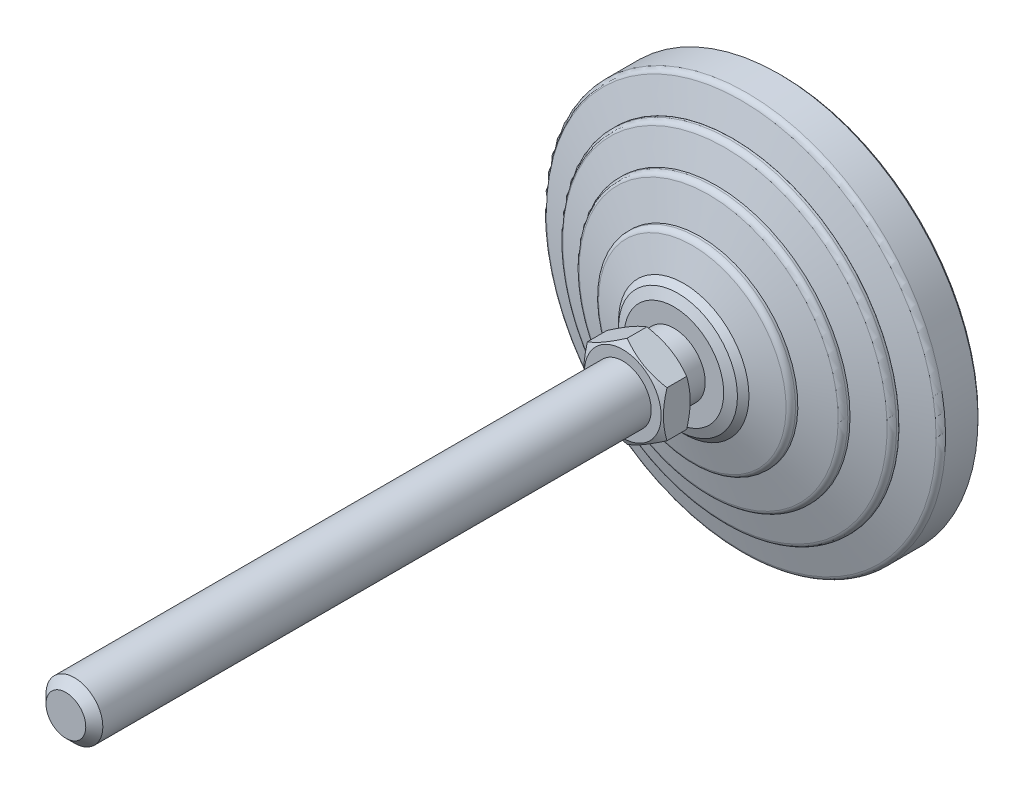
ISO-10303-21;
HEADER;
FILE_DESCRIPTION(('STEP AP214'),'2;1');
FILE_NAME('part.step','',(''),(''),'','','');
FILE_SCHEMA(('AUTOMOTIVE_DESIGN { 1 0 10303 214 1 1 1 1 }'));
ENDSEC;
DATA;
#1=APPLICATION_CONTEXT('core data for automotive mechanical design processes');
#2=APPLICATION_PROTOCOL_DEFINITION('international standard','automotive_design',2000,#1);
#3=PRODUCT_CONTEXT('',#1,'mechanical');
#4=PRODUCT('Part','Part','',(#3));
#5=PRODUCT_RELATED_PRODUCT_CATEGORY('part','',(#4));
#6=PRODUCT_DEFINITION_FORMATION('','',#4);
#7=PRODUCT_DEFINITION_CONTEXT('part definition',#1,'design');
#8=PRODUCT_DEFINITION('design','',#6,#7);
#9=PRODUCT_DEFINITION_SHAPE('','',#8);
#10=(LENGTH_UNIT() NAMED_UNIT(*) SI_UNIT(.MILLI.,.METRE.));
#11=(NAMED_UNIT(*) PLANE_ANGLE_UNIT() SI_UNIT($,.RADIAN.));
#12=(NAMED_UNIT(*) SI_UNIT($,.STERADIAN.) SOLID_ANGLE_UNIT());
#13=UNCERTAINTY_MEASURE_WITH_UNIT(LENGTH_MEASURE(1.E-05),#10,'distance_accuracy_value','');
#14=(GEOMETRIC_REPRESENTATION_CONTEXT(3) GLOBAL_UNCERTAINTY_ASSIGNED_CONTEXT((#13)) GLOBAL_UNIT_ASSIGNED_CONTEXT((#10,
#11,#12)) REPRESENTATION_CONTEXT('',''));
#15=CARTESIAN_POINT('',(0.,0.,0.));
#16=DIRECTION('',(0.,0.,1.));
#17=DIRECTION('',(1.,0.,0.));
#18=AXIS2_PLACEMENT_3D('',#15,#16,#17);
#19=CARTESIAN_POINT('',(-5.5,0.,23.));
#20=DIRECTION('',(0.,0.,1.));
#21=DIRECTION('',(0.,-1.,0.));
#22=AXIS2_PLACEMENT_3D('',#19,#20,#21);
#23=PLANE('',#22);
#24=CARTESIAN_POINT('',(0.,0.,22.9999999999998));
#25=DIRECTION('',(0.,0.,-1.));
#26=DIRECTION('',(-1.,0.,0.));
#27=AXIS2_PLACEMENT_3D('',#24,#25,#26);
#28=CIRCLE('',#27,6.75);
#29=CARTESIAN_POINT('',(-6.75,0.,22.9999999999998));
#30=VERTEX_POINT('',#29);
#31=EDGE_CURVE('E317',#30,#30,#28,.T.);
#32=ORIENTED_EDGE('',*,*,#31,.T.);
#33=EDGE_LOOP('',(#32));
#34=FACE_BOUND('',#33,.T.);
#35=CARTESIAN_POINT('',(0.,0.,23.));
#36=DIRECTION('',(0.,0.,-1.));
#37=DIRECTION('',(0.,1.,0.));
#38=AXIS2_PLACEMENT_3D('',#35,#36,#37);
#39=CIRCLE('',#38,5.5);
#40=CARTESIAN_POINT('',(0.,5.5,23.));
#41=VERTEX_POINT('',#40);
#42=EDGE_CURVE('E156',#41,#41,#39,.T.);
#43=ORIENTED_EDGE('',*,*,#42,.F.);
#44=EDGE_LOOP('',(#43));
#45=FACE_BOUND('',#44,.T.);
#46=ADVANCED_FACE('F14',(#34,#45),#23,.F.);
#47=CARTESIAN_POINT('',(0.,0.,0.));
#48=DIRECTION('',(0.,0.,-1.));
#49=DIRECTION('',(0.,1.,0.));
#50=AXIS2_PLACEMENT_3D('',#47,#48,#49);
#51=CYLINDRICAL_SURFACE('',#50,5.5);
#52=CARTESIAN_POINT('',(0.,0.,19.));
#53=DIRECTION('',(0.,0.,-1.));
#54=DIRECTION('',(0.,1.,0.));
#55=AXIS2_PLACEMENT_3D('',#52,#53,#54);
#56=CIRCLE('',#55,5.5);
#57=CARTESIAN_POINT('',(0.,5.5,19.));
#58=VERTEX_POINT('',#57);
#59=EDGE_CURVE('E153',#58,#58,#56,.T.);
#60=ORIENTED_EDGE('',*,*,#59,.F.);
#61=EDGE_LOOP('',(#60));
#62=FACE_BOUND('',#61,.T.);
#63=ORIENTED_EDGE('',*,*,#42,.T.);
#64=EDGE_LOOP('',(#63));
#65=FACE_BOUND('',#64,.T.);
#66=ADVANCED_FACE('F184',(#62,#65),#51,.T.);
#67=CARTESIAN_POINT('',(-8.75409836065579,0.,19.));
#68=DIRECTION('',(0.,0.,-1.));
#69=DIRECTION('',(0.,1.,0.));
#70=AXIS2_PLACEMENT_3D('',#67,#68,#69);
#71=PLANE('',#70);
#72=CARTESIAN_POINT('',(0.,0.,19.));
#73=DIRECTION('',(0.,0.,-1.));
#74=DIRECTION('',(0.,1.,0.));
#75=AXIS2_PLACEMENT_3D('',#72,#73,#74);
#76=CIRCLE('',#75,8.75409836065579);
#77=CARTESIAN_POINT('',(0.,8.75409836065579,19.));
#78=VERTEX_POINT('',#77);
#79=EDGE_CURVE('E150',#78,#78,#76,.T.);
#80=ORIENTED_EDGE('',*,*,#79,.F.);
#81=EDGE_LOOP('',(#80));
#82=FACE_BOUND('',#81,.T.);
#83=ORIENTED_EDGE('',*,*,#59,.T.);
#84=EDGE_LOOP('',(#83));
#85=FACE_BOUND('',#84,.T.);
#86=ADVANCED_FACE('F191',(#82,#85),#71,.F.);
#87=CARTESIAN_POINT('',(0.,0.,19.));
#88=DIRECTION('',(0.,0.,-1.));
#89=DIRECTION('',(0.,1.,0.));
#90=AXIS2_PLACEMENT_3D('',#87,#88,#89);
#91=CONICAL_SURFACE('',#90,8.75409836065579,1.17809724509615);
#92=CARTESIAN_POINT('',(0.,0.,18.2928932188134));
#93=DIRECTION('',(0.,0.,-1.));
#94=DIRECTION('',(0.,1.,0.));
#95=AXIS2_PLACEMENT_3D('',#92,#93,#94);
#96=CIRCLE('',#95,10.4612051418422);
#97=CARTESIAN_POINT('',(0.,10.4612051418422,18.2928932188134));
#98=VERTEX_POINT('',#97);
#99=EDGE_CURVE('E147',#98,#98,#96,.T.);
#100=ORIENTED_EDGE('',*,*,#99,.F.);
#101=EDGE_LOOP('',(#100));
#102=FACE_BOUND('',#101,.T.);
#103=ORIENTED_EDGE('',*,*,#79,.T.);
#104=EDGE_LOOP('',(#103));
#105=FACE_BOUND('',#104,.T.);
#106=ADVANCED_FACE('F548',(#102,#105),#91,.T.);
#107=CARTESIAN_POINT('',(0.,0.,18.2928932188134));
#108=DIRECTION('',(0.,0.,-1.));
#109=DIRECTION('',(0.,1.,0.));
#110=AXIS2_PLACEMENT_3D('',#107,#108,#109);
#111=CONICAL_SURFACE('',#110,10.4612051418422,0.785398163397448);
#112=CARTESIAN_POINT('',(0.,0.,17.2786885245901));
#113=DIRECTION('',(0.,0.,-1.));
#114=DIRECTION('',(0.,1.,0.));
#115=AXIS2_PLACEMENT_3D('',#112,#113,#114);
#116=CIRCLE('',#115,11.4754098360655);
#117=CARTESIAN_POINT('',(0.,11.4754098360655,17.2786885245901));
#118=VERTEX_POINT('',#117);
#119=EDGE_CURVE('E144',#118,#118,#116,.T.);
#120=ORIENTED_EDGE('',*,*,#119,.F.);
#121=EDGE_LOOP('',(#120));
#122=FACE_BOUND('',#121,.T.);
#123=ORIENTED_EDGE('',*,*,#99,.T.);
#124=EDGE_LOOP('',(#123));
#125=FACE_BOUND('',#124,.T.);
#126=ADVANCED_FACE('F539',(#122,#125),#111,.T.);
#127=CARTESIAN_POINT('',(0.,0.,17.2786885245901));
#128=DIRECTION('',(0.,0.,-1.));
#129=DIRECTION('',(0.,1.,0.));
#130=AXIS2_PLACEMENT_3D('',#127,#128,#129);
#131=CONICAL_SURFACE('',#130,11.4754098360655,1.27933953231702);
#132=CARTESIAN_POINT('',(0.,0.,15.7711726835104));
#133=DIRECTION('',(0.,0.,-1.));
#134=DIRECTION('',(0.,1.,0.));
#135=AXIS2_PLACEMENT_3D('',#132,#133,#134);
#136=CIRCLE('',#135,16.5004626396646);
#137=CARTESIAN_POINT('',(0.,16.5004626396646,15.7711726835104));
#138=VERTEX_POINT('',#137);
#139=EDGE_CURVE('E141',#138,#138,#136,.T.);
#140=ORIENTED_EDGE('',*,*,#139,.F.);
#141=EDGE_LOOP('',(#140));
#142=FACE_BOUND('',#141,.T.);
#143=ORIENTED_EDGE('',*,*,#119,.T.);
#144=EDGE_LOOP('',(#143));
#145=FACE_BOUND('',#144,.T.);
#146=ADVANCED_FACE('F530',(#142,#145),#131,.T.);
#147=CARTESIAN_POINT('',(0.,0.,14.8133463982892));
#148=DIRECTION('',(0.,0.,-1.));
#149=DIRECTION('',(0.,1.,0.));
#150=AXIS2_PLACEMENT_3D('',#147,#148,#149);
#151=TOROIDAL_SURFACE('',#150,16.2131147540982,1.);
#152=CARTESIAN_POINT('',(0.,0.,14.8133463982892));
#153=DIRECTION('',(0.,0.,-1.));
#154=DIRECTION('',(0.,1.,0.));
#155=AXIS2_PLACEMENT_3D('',#152,#153,#154);
#156=CIRCLE('',#155,17.2131147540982);
#157=CARTESIAN_POINT('',(0.,17.2131147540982,14.8133463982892));
#158=VERTEX_POINT('',#157);
#159=EDGE_CURVE('E138',#158,#158,#156,.T.);
#160=ORIENTED_EDGE('',*,*,#159,.F.);
#161=EDGE_LOOP('',(#160));
#162=FACE_BOUND('',#161,.T.);
#163=ORIENTED_EDGE('',*,*,#139,.T.);
#164=EDGE_LOOP('',(#163));
#165=FACE_BOUND('',#164,.T.);
#166=ADVANCED_FACE('F521',(#162,#165),#151,.T.);
#167=CARTESIAN_POINT('',(0.,0.,0.));
#168=DIRECTION('',(0.,0.,-1.));
#169=DIRECTION('',(0.,1.,0.));
#170=AXIS2_PLACEMENT_3D('',#167,#168,#169);
#171=CYLINDRICAL_SURFACE('',#170,17.2131147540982);
#172=CARTESIAN_POINT('',(0.,0.,14.4098360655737));
#173=DIRECTION('',(0.,0.,-1.));
#174=DIRECTION('',(0.,1.,0.));
#175=AXIS2_PLACEMENT_3D('',#172,#173,#174);
#176=CIRCLE('',#175,17.2131147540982);
#177=CARTESIAN_POINT('',(0.,17.2131147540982,14.4098360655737));
#178=VERTEX_POINT('',#177);
#179=EDGE_CURVE('E135',#178,#178,#176,.T.);
#180=ORIENTED_EDGE('',*,*,#179,.F.);
#181=EDGE_LOOP('',(#180));
#182=FACE_BOUND('',#181,.T.);
#183=ORIENTED_EDGE('',*,*,#159,.T.);
#184=EDGE_LOOP('',(#183));
#185=FACE_BOUND('',#184,.T.);
#186=ADVANCED_FACE('F512',(#182,#185),#171,.T.);
#187=CARTESIAN_POINT('',(0.,0.,14.4098360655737));
#188=DIRECTION('',(0.,0.,-1.));
#189=DIRECTION('',(0.,1.,0.));
#190=AXIS2_PLACEMENT_3D('',#187,#188,#189);
#191=CONICAL_SURFACE('',#190,17.2131147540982,1.30454427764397);
#192=CARTESIAN_POINT('',(0.,0.,12.8894925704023));
#193=DIRECTION('',(0.,0.,-1.));
#194=DIRECTION('',(0.,1.,0.));
#195=AXIS2_PLACEMENT_3D('',#192,#193,#194);
#196=CIRCLE('',#195,22.7877075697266);
#197=CARTESIAN_POINT('',(0.,22.7877075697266,12.8894925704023));
#198=VERTEX_POINT('',#197);
#199=EDGE_CURVE('E132',#198,#198,#196,.T.);
#200=ORIENTED_EDGE('',*,*,#199,.F.);
#201=EDGE_LOOP('',(#200));
#202=FACE_BOUND('',#201,.T.);
#203=ORIENTED_EDGE('',*,*,#179,.T.);
#204=EDGE_LOOP('',(#203));
#205=FACE_BOUND('',#204,.T.);
#206=ADVANCED_FACE('F503',(#202,#205),#191,.T.);
#207=CARTESIAN_POINT('',(0.,0.,11.9247287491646));
#208=DIRECTION('',(0.,0.,-1.));
#209=DIRECTION('',(0.,1.,0.));
#210=AXIS2_PLACEMENT_3D('',#207,#208,#209);
#211=TOROIDAL_SURFACE('',#210,22.5245901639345,1.);
#212=CARTESIAN_POINT('',(0.,0.,11.9247287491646));
#213=DIRECTION('',(0.,0.,-1.));
#214=DIRECTION('',(0.,1.,0.));
#215=AXIS2_PLACEMENT_3D('',#212,#213,#214);
#216=CIRCLE('',#215,23.5245901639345);
#217=CARTESIAN_POINT('',(0.,23.5245901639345,11.9247287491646));
#218=VERTEX_POINT('',#217);
#219=EDGE_CURVE('E129',#218,#218,#216,.T.);
#220=ORIENTED_EDGE('',*,*,#219,.F.);
#221=EDGE_LOOP('',(#220));
#222=FACE_BOUND('',#221,.T.);
#223=ORIENTED_EDGE('',*,*,#199,.T.);
#224=EDGE_LOOP('',(#223));
#225=FACE_BOUND('',#224,.T.);
#226=ADVANCED_FACE('F494',(#222,#225),#211,.T.);
#227=CARTESIAN_POINT('',(0.,0.,0.));
#228=DIRECTION('',(0.,0.,-1.));
#229=DIRECTION('',(0.,1.,0.));
#230=AXIS2_PLACEMENT_3D('',#227,#228,#229);
#231=CYLINDRICAL_SURFACE('',#230,23.5245901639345);
#232=CARTESIAN_POINT('',(0.,0.,11.5409836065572));
#233=DIRECTION('',(0.,0.,-1.));
#234=DIRECTION('',(0.,1.,0.));
#235=AXIS2_PLACEMENT_3D('',#232,#233,#234);
#236=CIRCLE('',#235,23.5245901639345);
#237=CARTESIAN_POINT('',(0.,23.5245901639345,11.5409836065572));
#238=VERTEX_POINT('',#237);
#239=EDGE_CURVE('E126',#238,#238,#236,.T.);
#240=ORIENTED_EDGE('',*,*,#239,.F.);
#241=EDGE_LOOP('',(#240));
#242=FACE_BOUND('',#241,.T.);
#243=ORIENTED_EDGE('',*,*,#219,.T.);
#244=EDGE_LOOP('',(#243));
#245=FACE_BOUND('',#244,.T.);
#246=ADVANCED_FACE('F485',(#242,#245),#231,.T.);
#247=CARTESIAN_POINT('',(0.,0.,11.5409836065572));
#248=DIRECTION('',(0.,0.,-1.));
#249=DIRECTION('',(0.,1.,0.));
#250=AXIS2_PLACEMENT_3D('',#247,#248,#249);
#251=CONICAL_SURFACE('',#250,23.5245901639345,1.2787125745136);
#252=CARTESIAN_POINT('',(0.,0.,10.0337743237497));
#253=DIRECTION('',(0.,0.,-1.));
#254=DIRECTION('',(0.,1.,0.));
#255=AXIS2_PLACEMENT_3D('',#252,#253,#254);
#256=CIRCLE('',#255,28.5372004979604);
#257=CARTESIAN_POINT('',(0.,28.5372004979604,10.0337743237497));
#258=VERTEX_POINT('',#257);
#259=EDGE_CURVE('E123',#258,#258,#256,.T.);
#260=ORIENTED_EDGE('',*,*,#259,.F.);
#261=EDGE_LOOP('',(#260));
#262=FACE_BOUND('',#261,.T.);
#263=ORIENTED_EDGE('',*,*,#239,.T.);
#264=EDGE_LOOP('',(#263));
#265=FACE_BOUND('',#264,.T.);
#266=ADVANCED_FACE('F476',(#262,#265),#251,.T.);
#267=CARTESIAN_POINT('',(0.,0.,9.07612838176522));
#268=DIRECTION('',(0.,0.,-1.));
#269=DIRECTION('',(0.,1.,0.));
#270=AXIS2_PLACEMENT_3D('',#267,#268,#269);
#271=TOROIDAL_SURFACE('',#270,28.2492521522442,1.);
#272=CARTESIAN_POINT('',(0.,0.,9.07612838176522));
#273=DIRECTION('',(0.,0.,-1.));
#274=DIRECTION('',(0.,1.,0.));
#275=AXIS2_PLACEMENT_3D('',#272,#273,#274);
#276=CIRCLE('',#275,29.2492521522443);
#277=CARTESIAN_POINT('',(0.,29.2492521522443,9.07612838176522));
#278=VERTEX_POINT('',#277);
#279=EDGE_CURVE('E120',#278,#278,#276,.T.);
#280=ORIENTED_EDGE('',*,*,#279,.F.);
#281=EDGE_LOOP('',(#280));
#282=FACE_BOUND('',#281,.T.);
#283=ORIENTED_EDGE('',*,*,#259,.T.);
#284=EDGE_LOOP('',(#283));
#285=FACE_BOUND('',#284,.T.);
#286=ADVANCED_FACE('F467',(#282,#285),#271,.T.);
#287=CARTESIAN_POINT('',(0.,0.,0.));
#288=DIRECTION('',(0.,0.,-1.));
#289=DIRECTION('',(0.,1.,0.));
#290=AXIS2_PLACEMENT_3D('',#287,#288,#289);
#291=CYLINDRICAL_SURFACE('',#290,29.2492521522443);
#292=CARTESIAN_POINT('',(0.,0.,8.67213114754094));
#293=DIRECTION('',(0.,0.,-1.));
#294=DIRECTION('',(0.,1.,0.));
#295=AXIS2_PLACEMENT_3D('',#292,#293,#294);
#296=CIRCLE('',#295,29.2492521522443);
#297=CARTESIAN_POINT('',(0.,29.2492521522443,8.67213114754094));
#298=VERTEX_POINT('',#297);
#299=EDGE_CURVE('E117',#298,#298,#296,.T.);
#300=ORIENTED_EDGE('',*,*,#299,.F.);
#301=EDGE_LOOP('',(#300));
#302=FACE_BOUND('',#301,.T.);
#303=ORIENTED_EDGE('',*,*,#279,.T.);
#304=EDGE_LOOP('',(#303));
#305=FACE_BOUND('',#304,.T.);
#306=ADVANCED_FACE('F458',(#302,#305),#291,.T.);
#307=CARTESIAN_POINT('',(-29.2622950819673,0.,8.67213114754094));
#308=DIRECTION('',(0.,0.,-1.));
#309=DIRECTION('',(0.,1.,0.));
#310=AXIS2_PLACEMENT_3D('',#307,#308,#309);
#311=PLANE('',#310);
#312=CARTESIAN_POINT('',(0.,0.,8.67213114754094));
#313=DIRECTION('',(0.,0.,-1.));
#314=DIRECTION('',(0.,1.,0.));
#315=AXIS2_PLACEMENT_3D('',#312,#313,#314);
#316=CIRCLE('',#315,29.2622950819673);
#317=CARTESIAN_POINT('',(0.,29.2622950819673,8.67213114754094));
#318=VERTEX_POINT('',#317);
#319=EDGE_CURVE('E114',#318,#318,#316,.T.);
#320=ORIENTED_EDGE('',*,*,#319,.F.);
#321=EDGE_LOOP('',(#320));
#322=FACE_BOUND('',#321,.T.);
#323=ORIENTED_EDGE('',*,*,#299,.T.);
#324=EDGE_LOOP('',(#323));
#325=FACE_BOUND('',#324,.T.);
#326=ADVANCED_FACE('F449',(#322,#325),#311,.F.);
#327=CARTESIAN_POINT('',(0.,0.,8.67213114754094));
#328=DIRECTION('',(0.,0.,-1.));
#329=DIRECTION('',(0.,1.,0.));
#330=AXIS2_PLACEMENT_3D('',#327,#328,#329);
#331=CONICAL_SURFACE('',#330,29.2622950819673,1.27933953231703);
#332=CARTESIAN_POINT('',(0.,0.,7.16461530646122));
#333=DIRECTION('',(0.,0.,-1.));
#334=DIRECTION('',(0.,1.,0.));
#335=AXIS2_PLACEMENT_3D('',#332,#333,#334);
#336=CIRCLE('',#335,34.2873478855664);
#337=CARTESIAN_POINT('',(0.,34.2873478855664,7.16461530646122));
#338=VERTEX_POINT('',#337);
#339=EDGE_CURVE('E111',#338,#338,#336,.T.);
#340=ORIENTED_EDGE('',*,*,#339,.F.);
#341=EDGE_LOOP('',(#340));
#342=FACE_BOUND('',#341,.T.);
#343=ORIENTED_EDGE('',*,*,#319,.T.);
#344=EDGE_LOOP('',(#343));
#345=FACE_BOUND('',#344,.T.);
#346=ADVANCED_FACE('F440',(#342,#345),#331,.T.);
#347=CARTESIAN_POINT('',(0.,0.,6.20678902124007));
#348=DIRECTION('',(0.,0.,-1.));
#349=DIRECTION('',(0.,1.,0.));
#350=AXIS2_PLACEMENT_3D('',#347,#348,#349);
#351=TOROIDAL_SURFACE('',#350,34.,1.);
#352=CARTESIAN_POINT('',(0.,0.,6.20678902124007));
#353=DIRECTION('',(0.,0.,-1.));
#354=DIRECTION('',(0.,1.,0.));
#355=AXIS2_PLACEMENT_3D('',#352,#353,#354);
#356=CIRCLE('',#355,35.);
#357=CARTESIAN_POINT('',(0.,35.,6.20678902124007));
#358=VERTEX_POINT('',#357);
#359=EDGE_CURVE('E108',#358,#358,#356,.T.);
#360=ORIENTED_EDGE('',*,*,#359,.F.);
#361=EDGE_LOOP('',(#360));
#362=FACE_BOUND('',#361,.T.);
#363=ORIENTED_EDGE('',*,*,#339,.T.);
#364=EDGE_LOOP('',(#363));
#365=FACE_BOUND('',#364,.T.);
#366=ADVANCED_FACE('F431',(#362,#365),#351,.T.);
#367=CARTESIAN_POINT('',(0.,0.,0.));
#368=DIRECTION('',(0.,0.,-1.));
#369=DIRECTION('',(0.,1.,0.));
#370=AXIS2_PLACEMENT_3D('',#367,#368,#369);
#371=CYLINDRICAL_SURFACE('',#370,35.);
#372=CARTESIAN_POINT('',(0.,0.,0.5));
#373=DIRECTION('',(0.,0.,-1.));
#374=DIRECTION('',(0.,1.,0.));
#375=AXIS2_PLACEMENT_3D('',#372,#373,#374);
#376=CIRCLE('',#375,35.);
#377=CARTESIAN_POINT('',(0.,35.,0.5));
#378=VERTEX_POINT('',#377);
#379=EDGE_CURVE('E105',#378,#378,#376,.T.);
#380=ORIENTED_EDGE('',*,*,#379,.F.);
#381=EDGE_LOOP('',(#380));
#382=FACE_BOUND('',#381,.T.);
#383=ORIENTED_EDGE('',*,*,#359,.T.);
#384=EDGE_LOOP('',(#383));
#385=FACE_BOUND('',#384,.T.);
#386=ADVANCED_FACE('F422',(#382,#385),#371,.T.);
#387=CARTESIAN_POINT('',(0.,0.,0.5));
#388=DIRECTION('',(0.,0.,1.));
#389=DIRECTION('',(0.,-1.,0.));
#390=AXIS2_PLACEMENT_3D('',#387,#388,#389);
#391=CONICAL_SURFACE('',#390,35.,0.785398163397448);
#392=CARTESIAN_POINT('',(0.,0.,0.));
#393=DIRECTION('',(0.,0.,-1.));
#394=DIRECTION('',(0.,1.,0.));
#395=AXIS2_PLACEMENT_3D('',#392,#393,#394);
#396=CIRCLE('',#395,34.5);
#397=CARTESIAN_POINT('',(0.,34.5,0.));
#398=VERTEX_POINT('',#397);
#399=EDGE_CURVE('E102',#398,#398,#396,.T.);
#400=ORIENTED_EDGE('',*,*,#399,.F.);
#401=EDGE_LOOP('',(#400));
#402=FACE_BOUND('',#401,.T.);
#403=ORIENTED_EDGE('',*,*,#379,.T.);
#404=EDGE_LOOP('',(#403));
#405=FACE_BOUND('',#404,.T.);
#406=ADVANCED_FACE('F415',(#402,#405),#391,.T.);
#407=CARTESIAN_POINT('',(-34.5,0.,0.));
#408=DIRECTION('',(0.,0.,1.));
#409=DIRECTION('',(0.,-1.,0.));
#410=AXIS2_PLACEMENT_3D('',#407,#408,#409);
#411=PLANE('',#410);
#412=ORIENTED_EDGE('',*,*,#399,.T.);
#413=EDGE_LOOP('',(#412));
#414=FACE_BOUND('',#413,.T.);
#415=ADVANCED_FACE('F181',(#414),#411,.F.);
#416=CARTESIAN_POINT('',(0.,0.,24.599703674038));
#417=DIRECTION('',(0.,0.,1.));
#418=DIRECTION('',(1.,0.,0.));
#419=AXIS2_PLACEMENT_3D('',#416,#417,#418);
#420=CONICAL_SURFACE('',#419,9.5207680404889,1.0471975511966);
#421=CARTESIAN_POINT('',(0.000200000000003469,-8.0830192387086,23.7696190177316));
#422=CARTESIAN_POINT('',(-0.153667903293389,-7.99418356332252,23.7183374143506));
#423=CARTESIAN_POINT('',(-0.308109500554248,-7.90501666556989,23.6693831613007));
#424=CARTESIAN_POINT('',(-0.618246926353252,-7.72595873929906,23.5767703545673));
#425=CARTESIAN_POINT('',(-0.773943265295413,-7.63606741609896,23.5331140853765));
#426=CARTESIAN_POINT('',(-1.24352516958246,-7.36495417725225,23.4109491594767));
#427=CARTESIAN_POINT('',(-1.5592643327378,-7.18266208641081,23.3414631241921));
#428=CARTESIAN_POINT('',(-2.03176224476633,-6.90986528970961,23.2599825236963));
#429=CARTESIAN_POINT('',(-2.18710922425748,-6.82017566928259,23.2367710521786));
#430=CARTESIAN_POINT('',(-2.49850511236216,-6.64039116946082,23.1978487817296));
#431=CARTESIAN_POINT('',(-2.6545539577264,-6.55029632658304,23.1821373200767));
#432=CARTESIAN_POINT('',(-2.96692267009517,-6.36995016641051,23.1586154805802));
#433=CARTESIAN_POINT('',(-3.12324202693,-6.27969914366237,23.15079613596));
#434=CARTESIAN_POINT('',(-3.43601650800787,-6.09911871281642,23.1432178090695));
#435=CARTESIAN_POINT('',(-3.59247162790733,-6.00878930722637,23.1434585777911));
#436=CARTESIAN_POINT('',(-4.02110687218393,-5.76131663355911,23.1551972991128));
#437=CARTESIAN_POINT('',(-4.29314668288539,-5.60425437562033,23.1749033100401));
#438=CARTESIAN_POINT('',(-4.83541944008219,-5.29117305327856,23.2373910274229));
#439=CARTESIAN_POINT('',(-5.10565047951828,-5.13515508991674,23.2801940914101));
#440=CARTESIAN_POINT('',(-5.64901454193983,-4.82144370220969,23.3871892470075));
#441=CARTESIAN_POINT('',(-5.92207900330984,-4.6637898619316,23.4518346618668));
#442=CARTESIAN_POINT('',(-6.46413578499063,-4.35083323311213,23.5985536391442));
#443=CARTESIAN_POINT('',(-6.73313504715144,-4.19552643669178,23.6805927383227));
#444=CARTESIAN_POINT('',(-7.0002,-4.04133641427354,23.7696190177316));
#445=B_SPLINE_CURVE_WITH_KNOTS('',3,(#421,#422,#423,#424,#425,#426,#427,#428,#429,#430,#431,
#432,#433,#434,#435,#436,#437,#438,#439,#440,#441,#442,#443,#444),.UNSPECIFIED.,.F.,.F.,(4,2,2,
2,2,2,2,2,2,2,2,4),(0.,0.554727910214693,1.10969417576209,2.2219327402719,2.76443041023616,
3.30688013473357,3.84871284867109,4.39052882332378,5.33376515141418,6.27787517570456,
7.2429241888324,8.20607866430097),.UNSPECIFIED.);
#446=CARTESIAN_POINT('',(0.,-8.08290376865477,23.7695523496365));
#447=VERTEX_POINT('',#446);
#448=CARTESIAN_POINT('',(-7.,-4.04145188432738,23.7695523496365));
#449=VERTEX_POINT('',#448);
#450=EDGE_CURVE('E73',#447,#449,#445,.T.);
#451=ORIENTED_EDGE('',*,*,#450,.T.);
#452=CARTESIAN_POINT('',(-7.,-10.8139424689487,26.5402093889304));
#453=CARTESIAN_POINT('',(-7.,-10.5085540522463,26.3922375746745));
#454=CARTESIAN_POINT('',(-7.,-10.2024600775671,26.2456967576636));
#455=CARTESIAN_POINT('',(-7.,-9.58848562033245,25.9562828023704));
#456=CARTESIAN_POINT('',(-7.,-9.28060486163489,25.8134102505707));
#457=CARTESIAN_POINT('',(-7.,-8.66107496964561,25.531410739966));
#458=CARTESIAN_POINT('',(-7.,-8.34941441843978,25.3923087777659));
#459=CARTESIAN_POINT('',(-7.,-7.72359979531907,25.119853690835));
#460=CARTESIAN_POINT('',(-7.,-7.40944584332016,24.9865002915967));
#461=CARTESIAN_POINT('',(-7.,-6.76816963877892,24.7229622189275));
#462=CARTESIAN_POINT('',(-7.,-6.44095110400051,24.5930105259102));
#463=CARTESIAN_POINT('',(-7.,-5.78267115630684,24.3430441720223));
#464=CARTESIAN_POINT('',(-7.,-5.45160931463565,24.2230306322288));
#465=CARTESIAN_POINT('',(-7.,-4.78574535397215,23.9961222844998));
#466=CARTESIAN_POINT('',(-7.,-4.45095250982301,23.8892005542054));
#467=CARTESIAN_POINT('',(-7.,-3.77657691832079,23.6919328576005));
#468=CARTESIAN_POINT('',(-7.,-3.43699572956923,23.601581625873));
#469=CARTESIAN_POINT('',(-7.,-2.75466927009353,23.4423024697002));
#470=CARTESIAN_POINT('',(-7.,-2.41195147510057,23.373260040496));
#471=CARTESIAN_POINT('',(-7.,-1.89478768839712,23.2886882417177));
#472=CARTESIAN_POINT('',(-7.,-1.72187222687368,23.263661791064));
#473=CARTESIAN_POINT('',(-7.,-1.37519614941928,23.2204313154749));
#474=CARTESIAN_POINT('',(-7.,-1.20143561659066,23.2022266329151));
#475=CARTESIAN_POINT('',(-7.,-0.855553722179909,23.1732285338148));
#476=CARTESIAN_POINT('',(-7.,-0.683440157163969,23.1623424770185));
#477=CARTESIAN_POINT('',(-7.,-0.338907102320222,23.1478555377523));
#478=CARTESIAN_POINT('',(-7.,-0.166487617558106,23.1442545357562));
#479=CARTESIAN_POINT('',(-7.,0.17834957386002,23.1444235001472));
#480=CARTESIAN_POINT('',(-7.,0.350767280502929,23.148193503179));
#481=CARTESIAN_POINT('',(-7.,0.695291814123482,23.1630130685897));
#482=CARTESIAN_POINT('',(-7.,0.867398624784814,23.1740630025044));
#483=CARTESIAN_POINT('',(-7.,1.28230155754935,23.2092441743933));
#484=CARTESIAN_POINT('',(-7.,1.52480495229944,23.2369004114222));
#485=CARTESIAN_POINT('',(-7.,2.00797283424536,23.3051474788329));
#486=CARTESIAN_POINT('',(-7.,2.2486370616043,23.345740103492));
#487=CARTESIAN_POINT('',(-7.,2.96761773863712,23.4847667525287));
#488=CARTESIAN_POINT('',(-7.,3.44264585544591,23.6004230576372));
#489=CARTESIAN_POINT('',(-7.,4.15288604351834,23.8004903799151));
#490=CARTESIAN_POINT('',(-7.,4.3917943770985,23.8725301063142));
#491=CARTESIAN_POINT('',(-7.,4.86728975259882,24.023969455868));
#492=CARTESIAN_POINT('',(-7.,5.10387677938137,24.1033691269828));
#493=CARTESIAN_POINT('',(-7.,5.57480635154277,24.2682646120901));
#494=CARTESIAN_POINT('',(-7.,5.80914963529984,24.3537583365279));
#495=CARTESIAN_POINT('',(-7.,6.27590285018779,24.5298482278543));
#496=CARTESIAN_POINT('',(-7.,6.50831280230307,24.6204443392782));
#497=CARTESIAN_POINT('',(-7.,7.04996382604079,24.8373435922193));
#498=CARTESIAN_POINT('',(-7.,7.35852736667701,24.9653354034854));
#499=CARTESIAN_POINT('',(-7.,7.97308971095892,25.2273521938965));
#500=CARTESIAN_POINT('',(-7.,8.27908836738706,25.3613775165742));
#501=CARTESIAN_POINT('',(-7.,8.88898378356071,25.6342687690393));
#502=CARTESIAN_POINT('',(-7.,9.19288013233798,25.7731356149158));
#503=CARTESIAN_POINT('',(-7.,9.79886937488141,26.0547568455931));
#504=CARTESIAN_POINT('',(-7.,10.1009622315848,26.1975113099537));
#505=CARTESIAN_POINT('',(-7.,10.7039374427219,26.4863337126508));
#506=CARTESIAN_POINT('',(-7.,11.0048182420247,26.6324048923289));
#507=CARTESIAN_POINT('',(-7.,11.6052965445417,26.9271639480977));
#508=CARTESIAN_POINT('',(-7.,11.9048940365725,27.0758518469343));
#509=CARTESIAN_POINT('',(-7.,12.8019884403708,27.5251168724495));
#510=CARTESIAN_POINT('',(-7.,13.3978635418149,27.8289321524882));
#511=CARTESIAN_POINT('',(-7.,14.5377445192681,28.4175123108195));
#512=CARTESIAN_POINT('',(-7.,15.0819990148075,28.7017978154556));
#513=CARTESIAN_POINT('',(-7.,16.168480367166,29.2742581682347));
#514=CARTESIAN_POINT('',(-7.,16.7107071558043,29.5624331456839));
#515=CARTESIAN_POINT('',(-7.,17.7922763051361,30.1410580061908));
#516=CARTESIAN_POINT('',(-7.,18.3316224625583,30.4315008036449));
#517=CARTESIAN_POINT('',(-7.,19.4090143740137,31.0147214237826));
#518=CARTESIAN_POINT('',(-7.,19.9470601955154,31.3074991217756));
#519=CARTESIAN_POINT('',(-7.,20.4846254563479,31.6011506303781));
#520=B_SPLINE_CURVE_WITH_KNOTS('',3,(#452,#453,#454,#455,#456,#457,#458,#459,#460,#461,#462,
#463,#464,#465,#466,#467,#468,#469,#470,#471,#472,#473,#474,#475,#476,#477,#478,#479,#480,#481,
#482,#483,#484,#485,#486,#487,#488,#489,#490,#491,#492,#493,#494,#495,#496,#497,#498,#499,#500,
#501,#502,#503,#504,#505,#506,#507,#508,#509,#510,#511,#512,#513,#514,#515,#516,#517,#518,#519),
.UNSPECIFIED.,.F.,.F.,(4,2,2,2,2,2,2,2,2,2,2,2,2,2,2,2,2,2,2,2,2,2,2,2,2,2,2,2,2,2,2,2,2,4),(0.,
1.01805963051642,2.03628102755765,3.06011679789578,4.08390362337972,5.14001449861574,
6.19624434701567,7.25026429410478,8.30394873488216,9.35186835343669,9.87590636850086,
10.3998938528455,10.9171170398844,11.4343317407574,11.9515490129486,12.4687926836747,
13.200604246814,13.9325173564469,15.3971726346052,16.145711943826,16.8942561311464,
17.6425448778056,18.390825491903,19.3929075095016,20.3950466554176,21.3973764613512,
22.3997267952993,23.4031028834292,24.40648769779,26.4130032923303,28.2550724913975,
30.0972030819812,31.93492972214,33.7725588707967),.UNSPECIFIED.);
#521=CARTESIAN_POINT('',(-7.,4.04145188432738,23.7695523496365));
#522=VERTEX_POINT('',#521);
#523=EDGE_CURVE('E81',#449,#522,#520,.T.);
#524=ORIENTED_EDGE('',*,*,#523,.T.);
#525=CARTESIAN_POINT('',(-7.0002,4.04133641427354,23.7696190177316));
#526=CARTESIAN_POINT('',(-6.84633209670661,4.13017208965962,23.7183374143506));
#527=CARTESIAN_POINT('',(-6.69189049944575,4.21933898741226,23.6693831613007));
#528=CARTESIAN_POINT('',(-6.38175307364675,4.39839691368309,23.5767703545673));
#529=CARTESIAN_POINT('',(-6.22605673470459,4.48828823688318,23.5331140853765));
#530=CARTESIAN_POINT('',(-5.75647483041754,4.75940147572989,23.4109491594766));
#531=CARTESIAN_POINT('',(-5.4407356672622,4.94169356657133,23.3414631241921));
#532=CARTESIAN_POINT('',(-4.96823775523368,5.21449036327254,23.2599825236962));
#533=CARTESIAN_POINT('',(-4.81289077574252,5.30417998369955,23.2367710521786));
#534=CARTESIAN_POINT('',(-4.50149488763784,5.48396448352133,23.1978487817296));
#535=CARTESIAN_POINT('',(-4.3454460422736,5.57405932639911,23.1821373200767));
#536=CARTESIAN_POINT('',(-4.03307732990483,5.75440548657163,23.1586154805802));
#537=CARTESIAN_POINT('',(-3.87675797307,5.84465650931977,23.15079613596));
#538=CARTESIAN_POINT('',(-3.56398349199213,6.02523694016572,23.1432178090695));
#539=CARTESIAN_POINT('',(-3.40752837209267,6.11556634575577,23.1434585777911));
#540=CARTESIAN_POINT('',(-2.97889312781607,6.36303901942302,23.1551972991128));
#541=CARTESIAN_POINT('',(-2.70685331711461,6.52010127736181,23.1749033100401));
#542=CARTESIAN_POINT('',(-2.16458055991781,6.83318259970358,23.2373910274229));
#543=CARTESIAN_POINT('',(-1.89434952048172,6.9892005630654,23.2801940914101));
#544=CARTESIAN_POINT('',(-1.35098545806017,7.30291195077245,23.3871892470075));
#545=CARTESIAN_POINT('',(-1.07792099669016,7.46056579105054,23.4518346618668));
#546=CARTESIAN_POINT('',(-0.535864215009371,7.77352241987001,23.5985536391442));
#547=CARTESIAN_POINT('',(-0.26686495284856,7.92882921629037,23.6805927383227));
#548=CARTESIAN_POINT('',(0.000199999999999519,8.0830192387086,23.7696190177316));
#549=B_SPLINE_CURVE_WITH_KNOTS('',3,(#525,#526,#527,#528,#529,#530,#531,#532,#533,#534,#535,
#536,#537,#538,#539,#540,#541,#542,#543,#544,#545,#546,#547,#548),.UNSPECIFIED.,.F.,.F.,(4,2,2,
2,2,2,2,2,2,2,2,4),(0.,0.554727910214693,1.10969417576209,2.22193274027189,2.76443041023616,
3.30688013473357,3.84871284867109,4.39052882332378,5.33376515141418,6.27787517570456,
7.2429241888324,8.20607866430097),.UNSPECIFIED.);
#550=CARTESIAN_POINT('',(0.,8.08290376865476,23.7695523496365));
#551=VERTEX_POINT('',#550);
#552=EDGE_CURVE('E284',#522,#551,#549,.T.);
#553=ORIENTED_EDGE('',*,*,#552,.T.);
#554=CARTESIAN_POINT('',(-0.000200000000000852,8.0830192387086,23.7696190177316));
#555=CARTESIAN_POINT('',(0.15366790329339,7.99418356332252,23.7183374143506));
#556=CARTESIAN_POINT('',(0.308109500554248,7.90501666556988,23.6693831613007));
#557=CARTESIAN_POINT('',(0.618246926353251,7.72595873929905,23.5767703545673));
#558=CARTESIAN_POINT('',(0.773943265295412,7.63606741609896,23.5331140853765));
#559=CARTESIAN_POINT('',(1.24352516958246,7.36495417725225,23.4109491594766));
#560=CARTESIAN_POINT('',(1.5592643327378,7.18266208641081,23.3414631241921));
#561=CARTESIAN_POINT('',(2.03176224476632,6.9098652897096,23.2599825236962));
#562=CARTESIAN_POINT('',(2.18710922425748,6.82017566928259,23.2367710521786));
#563=CARTESIAN_POINT('',(2.49850511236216,6.64039116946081,23.1978487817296));
#564=CARTESIAN_POINT('',(2.6545539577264,6.55029632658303,23.1821373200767));
#565=CARTESIAN_POINT('',(2.96692267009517,6.36995016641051,23.1586154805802));
#566=CARTESIAN_POINT('',(3.12324202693,6.27969914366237,23.15079613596));
#567=CARTESIAN_POINT('',(3.43601650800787,6.09911871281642,23.1432178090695));
#568=CARTESIAN_POINT('',(3.59247162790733,6.00878930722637,23.1434585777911));
#569=CARTESIAN_POINT('',(4.02110687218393,5.76131663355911,23.1551972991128));
#570=CARTESIAN_POINT('',(4.29314668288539,5.60425437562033,23.1749033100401));
#571=CARTESIAN_POINT('',(4.83541944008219,5.29117305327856,23.2373910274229));
#572=CARTESIAN_POINT('',(5.10565047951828,5.13515508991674,23.2801940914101));
#573=CARTESIAN_POINT('',(5.64901454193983,4.82144370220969,23.3871892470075));
#574=CARTESIAN_POINT('',(5.92207900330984,4.66378986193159,23.4518346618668));
#575=CARTESIAN_POINT('',(6.46413578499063,4.35083323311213,23.5985536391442));
#576=CARTESIAN_POINT('',(6.73313504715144,4.19552643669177,23.6805927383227));
#577=CARTESIAN_POINT('',(7.0002,4.04133641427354,23.7696190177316));
#578=B_SPLINE_CURVE_WITH_KNOTS('',3,(#554,#555,#556,#557,#558,#559,#560,#561,#562,#563,#564,
#565,#566,#567,#568,#569,#570,#571,#572,#573,#574,#575,#576,#577),.UNSPECIFIED.,.F.,.F.,(4,2,2,
2,2,2,2,2,2,2,2,4),(0.,0.554727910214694,1.10969417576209,2.2219327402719,2.76443041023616,
3.30688013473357,3.84871284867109,4.39052882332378,5.33376515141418,6.27787517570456,
7.2429241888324,8.20607866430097),.UNSPECIFIED.);
#579=CARTESIAN_POINT('',(7.,4.04145188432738,23.7695523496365));
#580=VERTEX_POINT('',#579);
#581=EDGE_CURVE('E285',#551,#580,#578,.T.);
#582=ORIENTED_EDGE('',*,*,#581,.T.);
#583=CARTESIAN_POINT('',(7.,-10.8139424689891,26.54020938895));
#584=CARTESIAN_POINT('',(7.,-10.5085540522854,26.3922375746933));
#585=CARTESIAN_POINT('',(7.,-10.2024600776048,26.2456967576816));
#586=CARTESIAN_POINT('',(7.,-9.58848562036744,25.9562828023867));
#587=CARTESIAN_POINT('',(7.,-9.28060486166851,25.8134102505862));
#588=CARTESIAN_POINT('',(7.,-8.66107496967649,25.5314107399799));
#589=CARTESIAN_POINT('',(7.,-8.34941441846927,25.392308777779));
#590=CARTESIAN_POINT('',(7.,-7.72359979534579,25.1198536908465));
#591=CARTESIAN_POINT('',(7.,-7.40944584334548,24.9865002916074));
#592=CARTESIAN_POINT('',(7.,-6.76816963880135,24.7229622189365));
#593=CARTESIAN_POINT('',(7.,-6.44095110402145,24.5930105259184));
#594=CARTESIAN_POINT('',(7.,-5.78267115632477,24.3430441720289));
#595=CARTESIAN_POINT('',(7.,-5.45160931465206,24.2230306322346));
#596=CARTESIAN_POINT('',(7.,-4.78574535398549,23.9961222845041));
#597=CARTESIAN_POINT('',(7.,-4.45095250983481,23.889200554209));
#598=CARTESIAN_POINT('',(7.,-3.77657691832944,23.6919328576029));
#599=CARTESIAN_POINT('',(7.,-3.43699572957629,23.6015816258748));
#600=CARTESIAN_POINT('',(7.,-2.75466927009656,23.4423024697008));
#601=CARTESIAN_POINT('',(7.,-2.41195147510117,23.373260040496));
#602=CARTESIAN_POINT('',(7.,-1.89478768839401,23.2886882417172));
#603=CARTESIAN_POINT('',(7.,-1.72187222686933,23.2636617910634));
#604=CARTESIAN_POINT('',(7.,-1.37519614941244,23.2204313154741));
#605=CARTESIAN_POINT('',(7.,-1.20143561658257,23.2022266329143));
#606=CARTESIAN_POINT('',(7.,-0.855553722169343,23.1732285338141));
#607=CARTESIAN_POINT('',(7.,-0.683440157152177,23.1623424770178));
#608=CARTESIAN_POINT('',(7.,-0.338907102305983,23.1478555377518));
#609=CARTESIAN_POINT('',(7.,-0.166487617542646,23.144254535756));
#610=CARTESIAN_POINT('',(7.,0.178349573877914,23.1444235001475));
#611=CARTESIAN_POINT('',(7.,0.350767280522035,23.1481935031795));
#612=CARTESIAN_POINT('',(7.,0.695291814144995,23.163013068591));
#613=CARTESIAN_POINT('',(7.,0.867398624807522,23.174063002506));
#614=CARTESIAN_POINT('',(7.,1.28230155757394,23.2092441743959));
#615=CARTESIAN_POINT('',(7.,1.52480495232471,23.2369004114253));
#616=CARTESIAN_POINT('',(7.,2.00797283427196,23.3051474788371));
#617=CARTESIAN_POINT('',(7.,2.24863706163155,23.3457401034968));
#618=CARTESIAN_POINT('',(7.,2.96761773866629,23.4847667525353));
#619=CARTESIAN_POINT('',(7.,3.4426458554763,23.600423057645));
#620=CARTESIAN_POINT('',(7.,4.15288604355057,23.8004903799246));
#621=CARTESIAN_POINT('',(7.,4.39179437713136,23.8725301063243));
#622=CARTESIAN_POINT('',(7.,4.86728975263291,24.0239694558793));
#623=CARTESIAN_POINT('',(7.,5.10387677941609,24.1033691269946));
#624=CARTESIAN_POINT('',(7.,5.57480635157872,24.268264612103));
#625=CARTESIAN_POINT('',(7.,5.8091496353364,24.3537583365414));
#626=CARTESIAN_POINT('',(7.,6.27590285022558,24.5298482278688));
#627=CARTESIAN_POINT('',(7.,6.50831280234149,24.6204443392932));
#628=CARTESIAN_POINT('',(7.,7.04996382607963,24.8373435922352));
#629=CARTESIAN_POINT('',(7.,7.35852736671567,24.9653354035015));
#630=CARTESIAN_POINT('',(7.,7.97308971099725,25.2273521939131));
#631=CARTESIAN_POINT('',(7.,8.27908836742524,25.361377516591));
#632=CARTESIAN_POINT('',(7.,8.8889837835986,25.6342687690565));
#633=CARTESIAN_POINT('',(7.,9.19288013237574,25.7731356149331));
#634=CARTESIAN_POINT('',(7.,9.7988693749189,26.0547568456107));
#635=CARTESIAN_POINT('',(7.,10.1009622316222,26.1975113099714));
#636=CARTESIAN_POINT('',(7.,10.703937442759,26.4863337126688));
#637=CARTESIAN_POINT('',(7.,11.0048182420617,26.632404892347));
#638=CARTESIAN_POINT('',(7.,11.6052965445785,26.9271639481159));
#639=CARTESIAN_POINT('',(7.,11.9048940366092,27.0758518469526));
#640=CARTESIAN_POINT('',(7.,12.8019884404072,27.5251168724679));
#641=CARTESIAN_POINT('',(7.,13.397863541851,27.8289321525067));
#642=CARTESIAN_POINT('',(7.,14.537744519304,28.4175123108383));
#643=CARTESIAN_POINT('',(7.,15.0819990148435,28.7017978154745));
#644=CARTESIAN_POINT('',(7.,16.1684803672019,29.2742581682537));
#645=CARTESIAN_POINT('',(7.,16.7107071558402,29.562433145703));
#646=CARTESIAN_POINT('',(7.,17.792276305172,30.1410580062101));
#647=CARTESIAN_POINT('',(7.,18.3316224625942,30.4315008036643));
#648=CARTESIAN_POINT('',(7.,19.4090143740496,31.0147214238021));
#649=CARTESIAN_POINT('',(7.,19.9470601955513,31.3074991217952));
#650=CARTESIAN_POINT('',(7.,20.4846254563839,31.6011506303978));
#651=B_SPLINE_CURVE_WITH_KNOTS('',3,(#583,#584,#585,#586,#587,#588,#589,#590,#591,#592,#593,
#594,#595,#596,#597,#598,#599,#600,#601,#602,#603,#604,#605,#606,#607,#608,#609,#610,#611,#612,
#613,#614,#615,#616,#617,#618,#619,#620,#621,#622,#623,#624,#625,#626,#627,#628,#629,#630,#631,
#632,#633,#634,#635,#636,#637,#638,#639,#640,#641,#642,#643,#644,#645,#646,#647,#648,#649,#650),
.UNSPECIFIED.,.F.,.F.,(4,2,2,2,2,2,2,2,2,2,2,2,2,2,2,2,2,2,2,2,2,2,2,2,2,2,2,2,2,2,2,2,2,4),(0.,
1.01805963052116,2.03628102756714,3.06011679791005,4.08390362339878,5.14001449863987,
6.19624434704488,7.25026429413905,8.30394873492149,9.3518683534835,9.87590636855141,
10.3998938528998,10.9171170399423,11.434331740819,11.9515490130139,12.4687926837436,
13.2006042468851,13.9325173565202,15.397172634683,16.1457119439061,16.8942561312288,
17.6425448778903,18.3908254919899,19.3929075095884,20.3950466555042,21.3973764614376,
22.3997267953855,23.4031028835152,24.4064876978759,26.4130032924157,28.255072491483,
30.0972030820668,31.9349297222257,33.7725588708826),.UNSPECIFIED.);
#652=CARTESIAN_POINT('',(7.,-4.04145188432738,23.7695523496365));
#653=VERTEX_POINT('',#652);
#654=EDGE_CURVE('E34',#580,#653,#651,.F.);
#655=ORIENTED_EDGE('',*,*,#654,.T.);
#656=CARTESIAN_POINT('',(7.0002,-4.04133641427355,23.7696190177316));
#657=CARTESIAN_POINT('',(6.84633209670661,-4.13017208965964,23.7183374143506));
#658=CARTESIAN_POINT('',(6.69189049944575,-4.21933898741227,23.6693831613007));
#659=CARTESIAN_POINT('',(6.38175307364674,-4.3983969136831,23.5767703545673));
#660=CARTESIAN_POINT('',(6.22605673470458,-4.4882882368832,23.5331140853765));
#661=CARTESIAN_POINT('',(5.75647483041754,-4.7594014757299,23.4109491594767));
#662=CARTESIAN_POINT('',(5.4407356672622,-4.94169356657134,23.3414631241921));
#663=CARTESIAN_POINT('',(4.96823775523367,-5.21449036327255,23.2599825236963));
#664=CARTESIAN_POINT('',(4.81289077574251,-5.30417998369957,23.2367710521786));
#665=CARTESIAN_POINT('',(4.50149488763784,-5.48396448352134,23.1978487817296));
#666=CARTESIAN_POINT('',(4.34544604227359,-5.57405932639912,23.1821373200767));
#667=CARTESIAN_POINT('',(4.03307732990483,-5.75440548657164,23.1586154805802));
#668=CARTESIAN_POINT('',(3.87675797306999,-5.84465650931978,23.15079613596));
#669=CARTESIAN_POINT('',(3.56398349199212,-6.02523694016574,23.1432178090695));
#670=CARTESIAN_POINT('',(3.40752837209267,-6.11556634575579,23.1434585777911));
#671=CARTESIAN_POINT('',(2.97889312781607,-6.36303901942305,23.1551972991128));
#672=CARTESIAN_POINT('',(2.7068533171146,-6.52010127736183,23.1749033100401));
#673=CARTESIAN_POINT('',(2.16458055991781,-6.83318259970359,23.2373910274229));
#674=CARTESIAN_POINT('',(1.89434952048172,-6.98920056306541,23.2801940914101));
#675=CARTESIAN_POINT('',(1.35098545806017,-7.30291195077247,23.3871892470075));
#676=CARTESIAN_POINT('',(1.07792099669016,-7.46056579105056,23.4518346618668));
#677=CARTESIAN_POINT('',(0.535864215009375,-7.77352241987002,23.5985536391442));
#678=CARTESIAN_POINT('',(0.266864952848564,-7.92882921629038,23.6805927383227));
#679=CARTESIAN_POINT('',(-0.000199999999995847,-8.08301923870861,23.7696190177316));
#680=B_SPLINE_CURVE_WITH_KNOTS('',3,(#656,#657,#658,#659,#660,#661,#662,#663,#664,#665,#666,
#667,#668,#669,#670,#671,#672,#673,#674,#675,#676,#677,#678,#679),.UNSPECIFIED.,.F.,.F.,(4,2,2,
2,2,2,2,2,2,2,2,4),(0.,0.554727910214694,1.10969417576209,2.2219327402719,2.76443041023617,
3.30688013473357,3.8487128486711,4.39052882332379,5.33376515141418,6.27787517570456,
7.24292418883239,8.20607866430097),.UNSPECIFIED.);
#681=EDGE_CURVE('E9',#653,#447,#680,.T.);
#682=ORIENTED_EDGE('',*,*,#681,.T.);
#683=EDGE_LOOP('',(#451,#524,#553,#582,#655,#682));
#684=FACE_BOUND('',#683,.T.);
#685=ORIENTED_EDGE('',*,*,#31,.F.);
#686=EDGE_LOOP('',(#685));
#687=FACE_BOUND('',#686,.T.);
#688=ADVANCED_FACE('F71',(#684,#687),#420,.T.);
#689=CARTESIAN_POINT('',(-3.49999999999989,0.,126.));
#690=DIRECTION('',(0.,0.,-1.));
#691=DIRECTION('',(0.,1.,0.));
#692=AXIS2_PLACEMENT_3D('',#689,#690,#691);
#693=PLANE('',#692);
#694=CARTESIAN_POINT('',(0.,0.,126.));
#695=DIRECTION('',(0.,0.,-1.));
#696=DIRECTION('',(0.,1.,0.));
#697=AXIS2_PLACEMENT_3D('',#694,#695,#696);
#698=CIRCLE('',#697,3.49999999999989);
#699=CARTESIAN_POINT('',(0.,3.49999999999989,126.));
#700=VERTEX_POINT('',#699);
#701=EDGE_CURVE('E99',#700,#700,#698,.T.);
#702=ORIENTED_EDGE('',*,*,#701,.F.);
#703=EDGE_LOOP('',(#702));
#704=FACE_BOUND('',#703,.T.);
#705=ADVANCED_FACE('F170',(#704),#693,.F.);
#706=CARTESIAN_POINT('',(0.,0.,126.));
#707=DIRECTION('',(0.,0.,-1.));
#708=DIRECTION('',(0.,1.,0.));
#709=AXIS2_PLACEMENT_3D('',#706,#707,#708);
#710=CONICAL_SURFACE('',#709,3.49999999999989,0.785398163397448);
#711=CARTESIAN_POINT('',(0.,0.,124.5));
#712=DIRECTION('',(0.,0.,-1.));
#713=DIRECTION('',(0.,1.,0.));
#714=AXIS2_PLACEMENT_3D('',#711,#712,#713);
#715=CIRCLE('',#714,4.99999999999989);
#716=CARTESIAN_POINT('',(0.,4.99999999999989,124.5));
#717=VERTEX_POINT('',#716);
#718=EDGE_CURVE('E96',#717,#717,#715,.T.);
#719=ORIENTED_EDGE('',*,*,#718,.F.);
#720=EDGE_LOOP('',(#719));
#721=FACE_BOUND('',#720,.T.);
#722=ORIENTED_EDGE('',*,*,#701,.T.);
#723=EDGE_LOOP('',(#722));
#724=FACE_BOUND('',#723,.T.);
#725=ADVANCED_FACE('F165',(#721,#724),#710,.T.);
#726=CARTESIAN_POINT('',(0.,0.,0.));
#727=DIRECTION('',(0.,0.,-1.));
#728=DIRECTION('',(0.,1.,0.));
#729=AXIS2_PLACEMENT_3D('',#726,#727,#728);
#730=CYLINDRICAL_SURFACE('',#729,4.99999999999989);
#731=CARTESIAN_POINT('',(0.,0.,28.));
#732=DIRECTION('',(0.,0.,-1.));
#733=DIRECTION('',(0.,1.,0.));
#734=AXIS2_PLACEMENT_3D('',#731,#732,#733);
#735=CIRCLE('',#734,4.99999999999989);
#736=CARTESIAN_POINT('',(0.,4.99999999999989,28.));
#737=VERTEX_POINT('',#736);
#738=EDGE_CURVE('E28',#737,#737,#735,.T.);
#739=ORIENTED_EDGE('',*,*,#738,.F.);
#740=EDGE_LOOP('',(#739));
#741=FACE_BOUND('',#740,.T.);
#742=ORIENTED_EDGE('',*,*,#718,.T.);
#743=EDGE_LOOP('',(#742));
#744=FACE_BOUND('',#743,.T.);
#745=ADVANCED_FACE('F16',(#741,#744),#730,.T.);
#746=CARTESIAN_POINT('',(-4.99999999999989,0.,28.));
#747=DIRECTION('',(0.,0.,-1.));
#748=DIRECTION('',(0.,1.,0.));
#749=AXIS2_PLACEMENT_3D('',#746,#747,#748);
#750=PLANE('',#749);
#751=CARTESIAN_POINT('',(0.,0.,28.));
#752=DIRECTION('',(0.,0.,-1.));
#753=DIRECTION('',(-1.,0.,0.));
#754=AXIS2_PLACEMENT_3D('',#751,#752,#753);
#755=CIRCLE('',#754,6.75);
#756=CARTESIAN_POINT('',(-6.75,0.,28.));
#757=VERTEX_POINT('',#756);
#758=EDGE_CURVE('E80',#757,#757,#755,.T.);
#759=ORIENTED_EDGE('',*,*,#758,.F.);
#760=EDGE_LOOP('',(#759));
#761=FACE_BOUND('',#760,.T.);
#762=ORIENTED_EDGE('',*,*,#738,.T.);
#763=EDGE_LOOP('',(#762));
#764=FACE_BOUND('',#763,.T.);
#765=ADVANCED_FACE('F161',(#761,#764),#750,.F.);
#766=CARTESIAN_POINT('',(0.,0.,28.));
#767=DIRECTION('',(0.,0.,-1.));
#768=DIRECTION('',(-1.,0.,0.));
#769=AXIS2_PLACEMENT_3D('',#766,#767,#768);
#770=CONICAL_SURFACE('',#769,6.75,1.0471975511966);
#771=CARTESIAN_POINT('',(-7.0002,-4.04133641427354,27.2303809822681));
#772=CARTESIAN_POINT('',(-6.84633209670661,-4.13017208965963,27.2816625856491));
#773=CARTESIAN_POINT('',(-6.69189049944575,-4.21933898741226,27.330616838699));
#774=CARTESIAN_POINT('',(-6.38175307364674,-4.3983969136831,27.4232296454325));
#775=CARTESIAN_POINT('',(-6.22605673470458,-4.48828823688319,27.4668859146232));
#776=CARTESIAN_POINT('',(-5.75647483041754,-4.7594014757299,27.5890508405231));
#777=CARTESIAN_POINT('',(-5.4407356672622,-4.94169356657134,27.6585368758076));
#778=CARTESIAN_POINT('',(-4.96823775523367,-5.21449036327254,27.7400174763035));
#779=CARTESIAN_POINT('',(-4.81289077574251,-5.30417998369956,27.7632289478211));
#780=CARTESIAN_POINT('',(-4.50149488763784,-5.48396448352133,27.8021512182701));
#781=CARTESIAN_POINT('',(-4.34544604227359,-5.57405932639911,27.8178626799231));
#782=CARTESIAN_POINT('',(-4.03307732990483,-5.75440548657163,27.8413845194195));
#783=CARTESIAN_POINT('',(-3.87675797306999,-5.84465650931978,27.8492038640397));
#784=CARTESIAN_POINT('',(-3.56398349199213,-6.02523694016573,27.8567821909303));
#785=CARTESIAN_POINT('',(-3.40752837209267,-6.11556634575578,27.8565414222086));
#786=CARTESIAN_POINT('',(-2.97889312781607,-6.36303901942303,27.844802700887));
#787=CARTESIAN_POINT('',(-2.7068533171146,-6.52010127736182,27.8250966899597));
#788=CARTESIAN_POINT('',(-2.1645805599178,-6.83318259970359,27.7626089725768));
#789=CARTESIAN_POINT('',(-1.89434952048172,-6.9892005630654,27.7198059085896));
#790=CARTESIAN_POINT('',(-1.35098545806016,-7.30291195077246,27.6128107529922));
#791=CARTESIAN_POINT('',(-1.07792099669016,-7.46056579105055,27.5481653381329));
#792=CARTESIAN_POINT('',(-0.535864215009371,-7.77352241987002,27.4014463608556));
#793=CARTESIAN_POINT('',(-0.266864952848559,-7.92882921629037,27.319407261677));
#794=CARTESIAN_POINT('',(0.000200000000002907,-8.0830192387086,27.2303809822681));
#795=B_SPLINE_CURVE_WITH_KNOTS('',3,(#771,#772,#773,#774,#775,#776,#777,#778,#779,#780,#781,
#782,#783,#784,#785,#786,#787,#788,#789,#790,#791,#792,#793,#794),.UNSPECIFIED.,.F.,.F.,(4,2,2,
2,2,2,2,2,2,2,2,4),(0.,0.554727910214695,1.10969417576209,2.2219327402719,2.76443041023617,
3.30688013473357,3.8487128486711,4.39052882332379,5.33376515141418,6.27787517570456,
7.2429241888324,8.20607866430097),.UNSPECIFIED.);
#796=CARTESIAN_POINT('',(-7.,-4.04145188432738,27.2304476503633));
#797=VERTEX_POINT('',#796);
#798=CARTESIAN_POINT('',(0.,-8.08290376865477,27.2304476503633));
#799=VERTEX_POINT('',#798);
#800=EDGE_CURVE('E88',#797,#799,#795,.T.);
#801=ORIENTED_EDGE('',*,*,#800,.T.);
#802=CARTESIAN_POINT('',(-0.000199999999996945,-8.08301923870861,27.2303809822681));
#803=CARTESIAN_POINT('',(0.153667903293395,-7.99418356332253,27.2816625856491));
#804=CARTESIAN_POINT('',(0.308109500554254,-7.90501666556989,27.330616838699));
#805=CARTESIAN_POINT('',(0.618246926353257,-7.72595873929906,27.4232296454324));
#806=CARTESIAN_POINT('',(0.773943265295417,-7.63606741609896,27.4668859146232));
#807=CARTESIAN_POINT('',(1.24352516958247,-7.36495417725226,27.5890508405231));
#808=CARTESIAN_POINT('',(1.5592643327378,-7.18266208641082,27.6585368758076));
#809=CARTESIAN_POINT('',(2.03176224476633,-6.90986528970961,27.7400174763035));
#810=CARTESIAN_POINT('',(2.18710922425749,-6.8201756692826,27.7632289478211));
#811=CARTESIAN_POINT('',(2.49850511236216,-6.64039116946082,27.8021512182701));
#812=CARTESIAN_POINT('',(2.65455395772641,-6.55029632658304,27.8178626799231));
#813=CARTESIAN_POINT('',(2.96692267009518,-6.36995016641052,27.8413845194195));
#814=CARTESIAN_POINT('',(3.12324202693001,-6.27969914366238,27.8492038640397));
#815=CARTESIAN_POINT('',(3.43601650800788,-6.09911871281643,27.8567821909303));
#816=CARTESIAN_POINT('',(3.59247162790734,-6.00878930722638,27.8565414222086));
#817=CARTESIAN_POINT('',(4.02110687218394,-5.76131663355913,27.844802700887));
#818=CARTESIAN_POINT('',(4.2931466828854,-5.60425437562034,27.8250966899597));
#819=CARTESIAN_POINT('',(4.8354194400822,-5.29117305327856,27.7626089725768));
#820=CARTESIAN_POINT('',(5.10565047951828,-5.13515508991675,27.7198059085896));
#821=CARTESIAN_POINT('',(5.64901454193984,-4.8214437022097,27.6128107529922));
#822=CARTESIAN_POINT('',(5.92207900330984,-4.66378986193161,27.5481653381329));
#823=CARTESIAN_POINT('',(6.46413578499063,-4.35083323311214,27.4014463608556));
#824=CARTESIAN_POINT('',(6.73313504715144,-4.19552643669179,27.319407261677));
#825=CARTESIAN_POINT('',(7.0002,-4.04133641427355,27.2303809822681));
#826=B_SPLINE_CURVE_WITH_KNOTS('',3,(#802,#803,#804,#805,#806,#807,#808,#809,#810,#811,#812,
#813,#814,#815,#816,#817,#818,#819,#820,#821,#822,#823,#824,#825),.UNSPECIFIED.,.F.,.F.,(4,2,2,
2,2,2,2,2,2,2,2,4),(0.,0.554727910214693,1.10969417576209,2.2219327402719,2.76443041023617,
3.30688013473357,3.8487128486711,4.39052882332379,5.33376515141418,6.27787517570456,
7.24292418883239,8.20607866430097),.UNSPECIFIED.);
#827=CARTESIAN_POINT('',(7.,-4.04145188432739,27.2304476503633));
#828=VERTEX_POINT('',#827);
#829=EDGE_CURVE('E86',#799,#828,#826,.T.);
#830=ORIENTED_EDGE('',*,*,#829,.T.);
#831=CARTESIAN_POINT('',(7.,-10.8139424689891,24.4597906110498));
#832=CARTESIAN_POINT('',(7.,-10.5085540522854,24.6077624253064));
#833=CARTESIAN_POINT('',(7.,-10.2024600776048,24.7543032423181));
#834=CARTESIAN_POINT('',(7.,-9.58848562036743,25.043717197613));
#835=CARTESIAN_POINT('',(7.,-9.2806048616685,25.1865897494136));
#836=CARTESIAN_POINT('',(7.,-8.66107496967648,25.4685892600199));
#837=CARTESIAN_POINT('',(7.,-8.34941441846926,25.6076912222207));
#838=CARTESIAN_POINT('',(7.,-7.72359979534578,25.8801463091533));
#839=CARTESIAN_POINT('',(7.,-7.40944584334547,26.0134997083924));
#840=CARTESIAN_POINT('',(7.,-6.76816963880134,26.2770377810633));
#841=CARTESIAN_POINT('',(7.,-6.44095110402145,26.4069894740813));
#842=CARTESIAN_POINT('',(7.,-5.78267115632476,26.6569558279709));
#843=CARTESIAN_POINT('',(7.,-5.45160931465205,26.7769693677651));
#844=CARTESIAN_POINT('',(7.,-4.78574535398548,27.0038777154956));
#845=CARTESIAN_POINT('',(7.,-4.4509525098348,27.1107994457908));
#846=CARTESIAN_POINT('',(7.,-3.77657691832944,27.3080671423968));
#847=CARTESIAN_POINT('',(7.,-3.43699572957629,27.3984183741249));
#848=CARTESIAN_POINT('',(7.,-2.75466927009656,27.5576975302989));
#849=CARTESIAN_POINT('',(7.,-2.41195147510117,27.6267399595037));
#850=CARTESIAN_POINT('',(7.,-1.89478768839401,27.7113117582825));
#851=CARTESIAN_POINT('',(7.,-1.72187222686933,27.7363382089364));
#852=CARTESIAN_POINT('',(7.,-1.37519614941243,27.7795686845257));
#853=CARTESIAN_POINT('',(7.,-1.20143561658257,27.7977733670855));
#854=CARTESIAN_POINT('',(7.,-0.855553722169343,27.8267714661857));
#855=CARTESIAN_POINT('',(7.,-0.683440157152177,27.8376575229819));
#856=CARTESIAN_POINT('',(7.,-0.338907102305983,27.8521444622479));
#857=CARTESIAN_POINT('',(7.,-0.166487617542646,27.8557454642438));
#858=CARTESIAN_POINT('',(7.,0.178349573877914,27.8555764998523));
#859=CARTESIAN_POINT('',(7.,0.350767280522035,27.8518064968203));
#860=CARTESIAN_POINT('',(7.,0.695291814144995,27.8369869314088));
#861=CARTESIAN_POINT('',(7.,0.867398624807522,27.8259369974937));
#862=CARTESIAN_POINT('',(7.,1.28230155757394,27.7907558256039));
#863=CARTESIAN_POINT('',(7.,1.52480495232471,27.7630995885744));
#864=CARTESIAN_POINT('',(7.,2.00797283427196,27.6948525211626));
#865=CARTESIAN_POINT('',(7.,2.24863706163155,27.654259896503));
#866=CARTESIAN_POINT('',(7.,2.96761773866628,27.5152332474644));
#867=CARTESIAN_POINT('',(7.,3.4426458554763,27.3995769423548));
#868=CARTESIAN_POINT('',(7.,4.15288604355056,27.1995096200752));
#869=CARTESIAN_POINT('',(7.,4.39179437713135,27.1274698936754));
#870=CARTESIAN_POINT('',(7.,4.86728975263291,26.9760305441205));
#871=CARTESIAN_POINT('',(7.,5.10387677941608,26.8966308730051));
#872=CARTESIAN_POINT('',(7.,5.5748063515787,26.7317353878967));
#873=CARTESIAN_POINT('',(7.,5.80914963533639,26.6462416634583));
#874=CARTESIAN_POINT('',(7.,6.27590285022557,26.4701517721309));
#875=CARTESIAN_POINT('',(7.,6.50831280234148,26.3795556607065));
#876=CARTESIAN_POINT('',(7.,7.04996382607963,26.1626564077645));
#877=CARTESIAN_POINT('',(7.,7.35852736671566,26.0346645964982));
#878=CARTESIAN_POINT('',(7.,7.97308971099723,25.7726478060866));
#879=CARTESIAN_POINT('',(7.,8.27908836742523,25.6386224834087));
#880=CARTESIAN_POINT('',(7.,8.88898378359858,25.3657312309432));
#881=CARTESIAN_POINT('',(7.,9.19288013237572,25.2268643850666));
#882=CARTESIAN_POINT('',(7.,9.79886937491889,24.945243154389));
#883=CARTESIAN_POINT('',(7.,10.1009622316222,24.8024886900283));
#884=CARTESIAN_POINT('',(7.,10.703937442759,24.5136662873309));
#885=CARTESIAN_POINT('',(7.,11.0048182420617,24.3675951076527));
#886=CARTESIAN_POINT('',(7.,11.6052965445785,24.0728360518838));
#887=CARTESIAN_POINT('',(7.,11.9048940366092,23.9241481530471));
#888=CARTESIAN_POINT('',(7.,12.8019884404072,23.4748831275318));
#889=CARTESIAN_POINT('',(7.,13.397863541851,23.171067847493));
#890=CARTESIAN_POINT('',(7.,14.537744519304,22.5824876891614));
#891=CARTESIAN_POINT('',(7.,15.0819990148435,22.2982021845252));
#892=CARTESIAN_POINT('',(7.,16.1684803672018,21.725741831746));
#893=CARTESIAN_POINT('',(7.,16.7107071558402,21.4375668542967));
#894=CARTESIAN_POINT('',(7.,17.792276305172,20.8589419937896));
#895=CARTESIAN_POINT('',(7.,18.3316224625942,20.5684991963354));
#896=CARTESIAN_POINT('',(7.,19.4090143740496,19.9852785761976));
#897=CARTESIAN_POINT('',(7.,19.9470601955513,19.6925008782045));
#898=CARTESIAN_POINT('',(7.,20.4846254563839,19.398849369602));
#899=B_SPLINE_CURVE_WITH_KNOTS('',3,(#831,#832,#833,#834,#835,#836,#837,#838,#839,#840,#841,
#842,#843,#844,#845,#846,#847,#848,#849,#850,#851,#852,#853,#854,#855,#856,#857,#858,#859,#860,
#861,#862,#863,#864,#865,#866,#867,#868,#869,#870,#871,#872,#873,#874,#875,#876,#877,#878,#879,
#880,#881,#882,#883,#884,#885,#886,#887,#888,#889,#890,#891,#892,#893,#894,#895,#896,#897,#898),
.UNSPECIFIED.,.F.,.F.,(4,2,2,2,2,2,2,2,2,2,2,2,2,2,2,2,2,2,2,2,2,2,2,2,2,2,2,2,2,2,2,2,2,4),(0.,
1.01805963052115,2.03628102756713,3.06011679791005,4.08390362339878,5.14001449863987,
6.19624434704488,7.25026429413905,8.30394873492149,9.3518683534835,9.87590636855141,
10.3998938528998,10.9171170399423,11.434331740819,11.9515490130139,12.4687926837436,
13.2006042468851,13.9325173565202,15.3971726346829,16.145711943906,16.8942561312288,
17.6425448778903,18.3908254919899,19.3929075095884,20.3950466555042,21.3973764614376,
22.3997267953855,23.4031028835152,24.4064876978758,26.4130032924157,28.255072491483,
30.0972030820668,31.9349297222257,33.7725588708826),.UNSPECIFIED.);
#900=CARTESIAN_POINT('',(7.,4.04145188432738,27.2304476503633));
#901=VERTEX_POINT('',#900);
#902=EDGE_CURVE('E210',#828,#901,#899,.T.);
#903=ORIENTED_EDGE('',*,*,#902,.T.);
#904=CARTESIAN_POINT('',(7.0002,4.04133641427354,27.2303809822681));
#905=CARTESIAN_POINT('',(6.84633209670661,4.13017208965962,27.2816625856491));
#906=CARTESIAN_POINT('',(6.69189049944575,4.21933898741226,27.330616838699));
#907=CARTESIAN_POINT('',(6.38175307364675,4.39839691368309,27.4232296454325));
#908=CARTESIAN_POINT('',(6.22605673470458,4.48828823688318,27.4668859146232));
#909=CARTESIAN_POINT('',(5.75647483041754,4.75940147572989,27.5890508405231));
#910=CARTESIAN_POINT('',(5.4407356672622,4.94169356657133,27.6585368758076));
#911=CARTESIAN_POINT('',(4.96823775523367,5.21449036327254,27.7400174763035));
#912=CARTESIAN_POINT('',(4.81289077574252,5.30417998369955,27.7632289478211));
#913=CARTESIAN_POINT('',(4.50149488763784,5.48396448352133,27.8021512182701));
#914=CARTESIAN_POINT('',(4.34544604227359,5.57405932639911,27.8178626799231));
#915=CARTESIAN_POINT('',(4.03307732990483,5.75440548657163,27.8413845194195));
#916=CARTESIAN_POINT('',(3.87675797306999,5.84465650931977,27.8492038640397));
#917=CARTESIAN_POINT('',(3.56398349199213,6.02523694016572,27.8567821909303));
#918=CARTESIAN_POINT('',(3.40752837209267,6.11556634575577,27.8565414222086));
#919=CARTESIAN_POINT('',(2.97889312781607,6.36303901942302,27.844802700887));
#920=CARTESIAN_POINT('',(2.7068533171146,6.52010127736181,27.8250966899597));
#921=CARTESIAN_POINT('',(2.16458055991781,6.83318259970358,27.7626089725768));
#922=CARTESIAN_POINT('',(1.89434952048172,6.9892005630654,27.7198059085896));
#923=CARTESIAN_POINT('',(1.35098545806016,7.30291195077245,27.6128107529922));
#924=CARTESIAN_POINT('',(1.07792099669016,7.46056579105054,27.5481653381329));
#925=CARTESIAN_POINT('',(0.53586421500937,7.77352241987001,27.4014463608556));
#926=CARTESIAN_POINT('',(0.26686495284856,7.92882921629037,27.319407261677));
#927=CARTESIAN_POINT('',(-0.000200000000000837,8.0830192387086,27.2303809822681));
#928=B_SPLINE_CURVE_WITH_KNOTS('',3,(#904,#905,#906,#907,#908,#909,#910,#911,#912,#913,#914,
#915,#916,#917,#918,#919,#920,#921,#922,#923,#924,#925,#926,#927),.UNSPECIFIED.,.F.,.F.,(4,2,2,
2,2,2,2,2,2,2,2,4),(0.,0.554727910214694,1.10969417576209,2.2219327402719,2.76443041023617,
3.30688013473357,3.84871284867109,4.39052882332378,5.33376515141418,6.27787517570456,
7.2429241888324,8.20607866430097),.UNSPECIFIED.);
#929=CARTESIAN_POINT('',(0.,8.08290376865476,27.2304476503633));
#930=VERTEX_POINT('',#929);
#931=EDGE_CURVE('E241',#901,#930,#928,.T.);
#932=ORIENTED_EDGE('',*,*,#931,.T.);
#933=CARTESIAN_POINT('',(0.00019999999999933,8.0830192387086,27.2303809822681));
#934=CARTESIAN_POINT('',(-0.153667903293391,7.99418356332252,27.2816625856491));
#935=CARTESIAN_POINT('',(-0.30810950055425,7.90501666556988,27.330616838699));
#936=CARTESIAN_POINT('',(-0.618246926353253,7.72595873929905,27.4232296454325));
#937=CARTESIAN_POINT('',(-0.773943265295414,7.63606741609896,27.4668859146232));
#938=CARTESIAN_POINT('',(-1.24352516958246,7.36495417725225,27.5890508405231));
#939=CARTESIAN_POINT('',(-1.5592643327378,7.18266208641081,27.6585368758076));
#940=CARTESIAN_POINT('',(-2.03176224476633,6.9098652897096,27.7400174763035));
#941=CARTESIAN_POINT('',(-2.18710922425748,6.82017566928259,27.7632289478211));
#942=CARTESIAN_POINT('',(-2.49850511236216,6.64039116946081,27.8021512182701));
#943=CARTESIAN_POINT('',(-2.65455395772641,6.55029632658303,27.8178626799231));
#944=CARTESIAN_POINT('',(-2.96692267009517,6.36995016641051,27.8413845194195));
#945=CARTESIAN_POINT('',(-3.12324202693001,6.27969914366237,27.8492038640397));
#946=CARTESIAN_POINT('',(-3.43601650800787,6.09911871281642,27.8567821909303));
#947=CARTESIAN_POINT('',(-3.59247162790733,6.00878930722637,27.8565414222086));
#948=CARTESIAN_POINT('',(-4.02110687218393,5.76131663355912,27.844802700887));
#949=CARTESIAN_POINT('',(-4.2931466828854,5.60425437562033,27.8250966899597));
#950=CARTESIAN_POINT('',(-4.83541944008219,5.29117305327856,27.7626089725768));
#951=CARTESIAN_POINT('',(-5.10565047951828,5.13515508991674,27.7198059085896));
#952=CARTESIAN_POINT('',(-5.64901454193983,4.82144370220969,27.6128107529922));
#953=CARTESIAN_POINT('',(-5.92207900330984,4.66378986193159,27.5481653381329));
#954=CARTESIAN_POINT('',(-6.46413578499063,4.35083323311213,27.4014463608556));
#955=CARTESIAN_POINT('',(-6.73313504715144,4.19552643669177,27.319407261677));
#956=CARTESIAN_POINT('',(-7.0002,4.04133641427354,27.2303809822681));
#957=B_SPLINE_CURVE_WITH_KNOTS('',3,(#933,#934,#935,#936,#937,#938,#939,#940,#941,#942,#943,
#944,#945,#946,#947,#948,#949,#950,#951,#952,#953,#954,#955,#956),.UNSPECIFIED.,.F.,.F.,(4,2,2,
2,2,2,2,2,2,2,2,4),(0.,0.554727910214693,1.10969417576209,2.2219327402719,2.76443041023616,
3.30688013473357,3.84871284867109,4.39052882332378,5.33376515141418,6.27787517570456,
7.2429241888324,8.20607866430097),.UNSPECIFIED.);
#958=CARTESIAN_POINT('',(-7.,4.04145188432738,27.2304476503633));
#959=VERTEX_POINT('',#958);
#960=EDGE_CURVE('E248',#930,#959,#957,.T.);
#961=ORIENTED_EDGE('',*,*,#960,.T.);
#962=CARTESIAN_POINT('',(-7.,-10.8139424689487,24.4597906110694));
#963=CARTESIAN_POINT('',(-7.,-10.5085540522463,24.6077624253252));
#964=CARTESIAN_POINT('',(-7.,-10.202460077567,24.7543032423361));
#965=CARTESIAN_POINT('',(-7.,-9.58848562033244,25.0437171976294));
#966=CARTESIAN_POINT('',(-7.,-9.28060486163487,25.1865897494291));
#967=CARTESIAN_POINT('',(-7.,-8.6610749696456,25.4685892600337));
#968=CARTESIAN_POINT('',(-7.,-8.34941441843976,25.6076912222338));
#969=CARTESIAN_POINT('',(-7.,-7.72359979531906,25.8801463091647));
#970=CARTESIAN_POINT('',(-7.,-7.40944584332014,26.013499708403));
#971=CARTESIAN_POINT('',(-7.,-6.7681696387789,26.2770377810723));
#972=CARTESIAN_POINT('',(-7.,-6.4409511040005,26.4069894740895));
#973=CARTESIAN_POINT('',(-7.,-5.78267115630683,26.6569558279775));
#974=CARTESIAN_POINT('',(-7.,-5.45160931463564,26.7769693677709));
#975=CARTESIAN_POINT('',(-7.,-4.78574535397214,27.0038777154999));
#976=CARTESIAN_POINT('',(-7.,-4.450952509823,27.1107994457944));
#977=CARTESIAN_POINT('',(-7.,-3.77657691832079,27.3080671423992));
#978=CARTESIAN_POINT('',(-7.,-3.43699572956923,27.3984183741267));
#979=CARTESIAN_POINT('',(-7.,-2.75466927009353,27.5576975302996));
#980=CARTESIAN_POINT('',(-7.,-2.41195147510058,27.6267399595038));
#981=CARTESIAN_POINT('',(-7.,-1.89478768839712,27.7113117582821));
#982=CARTESIAN_POINT('',(-7.,-1.72187222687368,27.7363382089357));
#983=CARTESIAN_POINT('',(-7.,-1.37519614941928,27.7795686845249));
#984=CARTESIAN_POINT('',(-7.,-1.20143561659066,27.7977733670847));
#985=CARTESIAN_POINT('',(-7.,-0.855553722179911,27.8267714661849));
#986=CARTESIAN_POINT('',(-7.,-0.68344015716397,27.8376575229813));
#987=CARTESIAN_POINT('',(-7.,-0.338907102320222,27.8521444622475));
#988=CARTESIAN_POINT('',(-7.,-0.166487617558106,27.8557454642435));
#989=CARTESIAN_POINT('',(-7.,0.17834957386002,27.8555764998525));
#990=CARTESIAN_POINT('',(-7.,0.350767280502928,27.8518064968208));
#991=CARTESIAN_POINT('',(-7.,0.695291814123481,27.83698693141));
#992=CARTESIAN_POINT('',(-7.,0.867398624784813,27.8259369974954));
#993=CARTESIAN_POINT('',(-7.,1.28230155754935,27.7907558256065));
#994=CARTESIAN_POINT('',(-7.,1.52480495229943,27.7630995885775));
#995=CARTESIAN_POINT('',(-7.,2.00797283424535,27.6948525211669));
#996=CARTESIAN_POINT('',(-7.,2.24863706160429,27.6542598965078));
#997=CARTESIAN_POINT('',(-7.,2.96761773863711,27.515233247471));
#998=CARTESIAN_POINT('',(-7.,3.4426458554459,27.3995769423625));
#999=CARTESIAN_POINT('',(-7.,4.15288604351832,27.1995096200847));
#1000=CARTESIAN_POINT('',(-7.,4.39179437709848,27.1274698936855));
#1001=CARTESIAN_POINT('',(-7.,4.8672897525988,26.9760305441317));
#1002=CARTESIAN_POINT('',(-7.,5.10387677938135,26.896630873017));
#1003=CARTESIAN_POINT('',(-7.,5.57480635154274,26.7317353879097));
#1004=CARTESIAN_POINT('',(-7.,5.80914963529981,26.6462416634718));
#1005=CARTESIAN_POINT('',(-7.,6.27590285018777,26.4701517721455));
#1006=CARTESIAN_POINT('',(-7.,6.50831280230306,26.3795556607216));
#1007=CARTESIAN_POINT('',(-7.,7.04996382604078,26.1626564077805));
#1008=CARTESIAN_POINT('',(-7.,7.35852736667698,26.0346645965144));
#1009=CARTESIAN_POINT('',(-7.,7.97308971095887,25.7726478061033));
#1010=CARTESIAN_POINT('',(-7.,8.27908836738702,25.6386224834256));
#1011=CARTESIAN_POINT('',(-7.,8.88898378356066,25.3657312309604));
#1012=CARTESIAN_POINT('',(-7.,9.19288013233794,25.226864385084));
#1013=CARTESIAN_POINT('',(-7.,9.79886937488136,24.9452431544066));
#1014=CARTESIAN_POINT('',(-7.,10.1009622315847,24.802488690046));
#1015=CARTESIAN_POINT('',(-7.,10.7039374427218,24.5136662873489));
#1016=CARTESIAN_POINT('',(-7.,11.0048182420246,24.3675951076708));
#1017=CARTESIAN_POINT('',(-7.,11.6052965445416,24.0728360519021));
#1018=CARTESIAN_POINT('',(-7.,11.9048940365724,23.9241481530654));
#1019=CARTESIAN_POINT('',(-7.,12.8019884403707,23.4748831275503));
#1020=CARTESIAN_POINT('',(-7.,13.3978635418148,23.1710678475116));
#1021=CARTESIAN_POINT('',(-7.,14.537744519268,22.5824876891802));
#1022=CARTESIAN_POINT('',(-7.,15.0819990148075,22.2982021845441));
#1023=CARTESIAN_POINT('',(-7.,16.1684803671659,21.725741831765));
#1024=CARTESIAN_POINT('',(-7.,16.7107071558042,21.4375668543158));
#1025=CARTESIAN_POINT('',(-7.,17.7922763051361,20.8589419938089));
#1026=CARTESIAN_POINT('',(-7.,18.3316224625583,20.5684991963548));
#1027=CARTESIAN_POINT('',(-7.,19.4090143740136,19.9852785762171));
#1028=CARTESIAN_POINT('',(-7.,19.9470601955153,19.6925008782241));
#1029=CARTESIAN_POINT('',(-7.,20.4846254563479,19.3988493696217));
#1030=B_SPLINE_CURVE_WITH_KNOTS('',3,(#962,#963,#964,#965,#966,#967,#968,#969,#970,#971,#972,
#973,#974,#975,#976,#977,#978,#979,#980,#981,#982,#983,#984,#985,#986,#987,#988,#989,#990,#991,
#992,#993,#994,#995,#996,#997,#998,#999,#1000,#1001,#1002,#1003,#1004,#1005,#1006,#1007,#1008,
#1009,#1010,#1011,#1012,#1013,#1014,#1015,#1016,#1017,#1018,#1019,#1020,#1021,#1022,#1023,#1024,
#1025,#1026,#1027,#1028,#1029),.UNSPECIFIED.,.F.,.F.,(4,2,2,2,2,2,2,2,2,2,2,2,2,2,2,2,2,2,2,2,2,
2,2,2,2,2,2,2,2,2,2,2,2,4),(0.,1.01805963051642,2.03628102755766,3.06011679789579,
4.08390362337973,5.14001449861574,6.19624434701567,7.25026429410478,8.30394873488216,
9.35186835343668,9.87590636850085,10.3998938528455,10.9171170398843,11.4343317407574,
11.9515490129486,12.4687926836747,13.200604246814,13.9325173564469,15.3971726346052,
16.145711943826,16.8942561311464,17.6425448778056,18.390825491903,19.3929075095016,
20.3950466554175,21.3973764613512,22.3997267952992,23.4031028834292,24.40648769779,
26.4130032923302,28.2550724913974,30.0972030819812,31.9349297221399,33.7725588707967),.UNSPECIFIED.);
#1031=EDGE_CURVE('E92',#959,#797,#1030,.F.);
#1032=ORIENTED_EDGE('',*,*,#1031,.T.);
#1033=EDGE_LOOP('',(#801,#830,#903,#932,#961,#1032));
#1034=FACE_BOUND('',#1033,.T.);
#1035=ORIENTED_EDGE('',*,*,#758,.T.);
#1036=EDGE_LOOP('',(#1035));
#1037=FACE_BOUND('',#1036,.T.);
#1038=ADVANCED_FACE('F198',(#1034,#1037),#770,.T.);
#1039=CARTESIAN_POINT('',(0.,-8.08290376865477,22.9999999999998));
#1040=DIRECTION('',(0.5,-0.866025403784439,0.));
#1041=DIRECTION('',(0.866025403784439,0.5,0.));
#1042=AXIS2_PLACEMENT_3D('',#1039,#1040,#1041);
#1043=PLANE('',#1042);
#1044=ORIENTED_EDGE('',*,*,#681,.F.);
#1045=DIRECTION('',(0.,0.,1.));
#1046=VECTOR('',#1045,1.);
#1047=CARTESIAN_POINT('',(7.,-4.04145188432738,22.9999999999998));
#1048=LINE('',#1047,#1046);
#1049=EDGE_CURVE('E87',#653,#828,#1048,.T.);
#1050=ORIENTED_EDGE('',*,*,#1049,.T.);
#1051=ORIENTED_EDGE('',*,*,#829,.F.);
#1052=DIRECTION('',(0.,0.,1.));
#1053=VECTOR('',#1052,1.);
#1054=CARTESIAN_POINT('',(0.,-8.08290376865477,22.9999999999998));
#1055=LINE('',#1054,#1053);
#1056=EDGE_CURVE('E42',#447,#799,#1055,.T.);
#1057=ORIENTED_EDGE('',*,*,#1056,.F.);
#1058=EDGE_LOOP('',(#1044,#1050,#1051,#1057));
#1059=FACE_BOUND('',#1058,.T.);
#1060=ADVANCED_FACE('F84',(#1059),#1043,.T.);
#1061=CARTESIAN_POINT('',(7.,-4.04145188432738,22.9999999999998));
#1062=DIRECTION('',(1.,0.,0.));
#1063=DIRECTION('',(0.,1.,0.));
#1064=AXIS2_PLACEMENT_3D('',#1061,#1062,#1063);
#1065=PLANE('',#1064);
#1066=ORIENTED_EDGE('',*,*,#654,.F.);
#1067=DIRECTION('',(0.,0.,1.));
#1068=VECTOR('',#1067,1.);
#1069=CARTESIAN_POINT('',(7.,4.04145188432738,22.9999999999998));
#1070=LINE('',#1069,#1068);
#1071=EDGE_CURVE('E90',#580,#901,#1070,.T.);
#1072=ORIENTED_EDGE('',*,*,#1071,.T.);
#1073=ORIENTED_EDGE('',*,*,#902,.F.);
#1074=ORIENTED_EDGE('',*,*,#1049,.F.);
#1075=EDGE_LOOP('',(#1066,#1072,#1073,#1074));
#1076=FACE_BOUND('',#1075,.T.);
#1077=ADVANCED_FACE('F305',(#1076),#1065,.T.);
#1078=CARTESIAN_POINT('',(7.,4.04145188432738,22.9999999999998));
#1079=DIRECTION('',(0.5,0.866025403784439,0.));
#1080=DIRECTION('',(-0.866025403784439,0.5,0.));
#1081=AXIS2_PLACEMENT_3D('',#1078,#1079,#1080);
#1082=PLANE('',#1081);
#1083=ORIENTED_EDGE('',*,*,#581,.F.);
#1084=DIRECTION('',(0.,0.,1.));
#1085=VECTOR('',#1084,1.);
#1086=CARTESIAN_POINT('',(0.,8.08290376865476,22.9999999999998));
#1087=LINE('',#1086,#1085);
#1088=EDGE_CURVE('E326',#551,#930,#1087,.T.);
#1089=ORIENTED_EDGE('',*,*,#1088,.T.);
#1090=ORIENTED_EDGE('',*,*,#931,.F.);
#1091=ORIENTED_EDGE('',*,*,#1071,.F.);
#1092=EDGE_LOOP('',(#1083,#1089,#1090,#1091));
#1093=FACE_BOUND('',#1092,.T.);
#1094=ADVANCED_FACE('F278',(#1093),#1082,.T.);
#1095=CARTESIAN_POINT('',(0.,8.08290376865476,22.9999999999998));
#1096=DIRECTION('',(-0.5,0.866025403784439,0.));
#1097=DIRECTION('',(-0.866025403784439,-0.5,0.));
#1098=AXIS2_PLACEMENT_3D('',#1095,#1096,#1097);
#1099=PLANE('',#1098);
#1100=ORIENTED_EDGE('',*,*,#552,.F.);
#1101=DIRECTION('',(0.,0.,1.));
#1102=VECTOR('',#1101,1.);
#1103=CARTESIAN_POINT('',(-7.,4.04145188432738,22.9999999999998));
#1104=LINE('',#1103,#1102);
#1105=EDGE_CURVE('E282',#522,#959,#1104,.T.);
#1106=ORIENTED_EDGE('',*,*,#1105,.T.);
#1107=ORIENTED_EDGE('',*,*,#960,.F.);
#1108=ORIENTED_EDGE('',*,*,#1088,.F.);
#1109=EDGE_LOOP('',(#1100,#1106,#1107,#1108));
#1110=FACE_BOUND('',#1109,.T.);
#1111=ADVANCED_FACE('F272',(#1110),#1099,.T.);
#1112=CARTESIAN_POINT('',(-7.,4.04145188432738,22.9999999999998));
#1113=DIRECTION('',(-1.,0.,0.));
#1114=DIRECTION('',(0.,-1.,0.));
#1115=AXIS2_PLACEMENT_3D('',#1112,#1113,#1114);
#1116=PLANE('',#1115);
#1117=ORIENTED_EDGE('',*,*,#523,.F.);
#1118=DIRECTION('',(0.,0.,1.));
#1119=VECTOR('',#1118,1.);
#1120=CARTESIAN_POINT('',(-7.,-4.04145188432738,22.9999999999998));
#1121=LINE('',#1120,#1119);
#1122=EDGE_CURVE('E79',#449,#797,#1121,.T.);
#1123=ORIENTED_EDGE('',*,*,#1122,.T.);
#1124=ORIENTED_EDGE('',*,*,#1031,.F.);
#1125=ORIENTED_EDGE('',*,*,#1105,.F.);
#1126=EDGE_LOOP('',(#1117,#1123,#1124,#1125));
#1127=FACE_BOUND('',#1126,.T.);
#1128=ADVANCED_FACE('F233',(#1127),#1116,.T.);
#1129=CARTESIAN_POINT('',(-7.,-4.04145188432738,22.9999999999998));
#1130=DIRECTION('',(-0.5,-0.866025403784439,0.));
#1131=DIRECTION('',(0.866025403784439,-0.5,0.));
#1132=AXIS2_PLACEMENT_3D('',#1129,#1130,#1131);
#1133=PLANE('',#1132);
#1134=ORIENTED_EDGE('',*,*,#450,.F.);
#1135=ORIENTED_EDGE('',*,*,#1056,.T.);
#1136=ORIENTED_EDGE('',*,*,#800,.F.);
#1137=ORIENTED_EDGE('',*,*,#1122,.F.);
#1138=EDGE_LOOP('',(#1134,#1135,#1136,#1137));
#1139=FACE_BOUND('',#1138,.T.);
#1140=ADVANCED_FACE('F78',(#1139),#1133,.T.);
#1141=CLOSED_SHELL('',(#46,#66,#86,#106,#126,#146,#166,#186,#206,#226,#246,#266,#286,#306,#326,
#346,#366,#386,#406,#415,#688,#705,#725,#745,#765,#1038,#1060,#1077,#1094,#1111,#1128,#1140));
#1142=MANIFOLD_SOLID_BREP('B1',#1141);
#1143=ADVANCED_BREP_SHAPE_REPRESENTATION('',(#18,#1142),#14);
#1144=SHAPE_DEFINITION_REPRESENTATION(#9,#1143);
ENDSEC;
END-ISO-10303-21;
